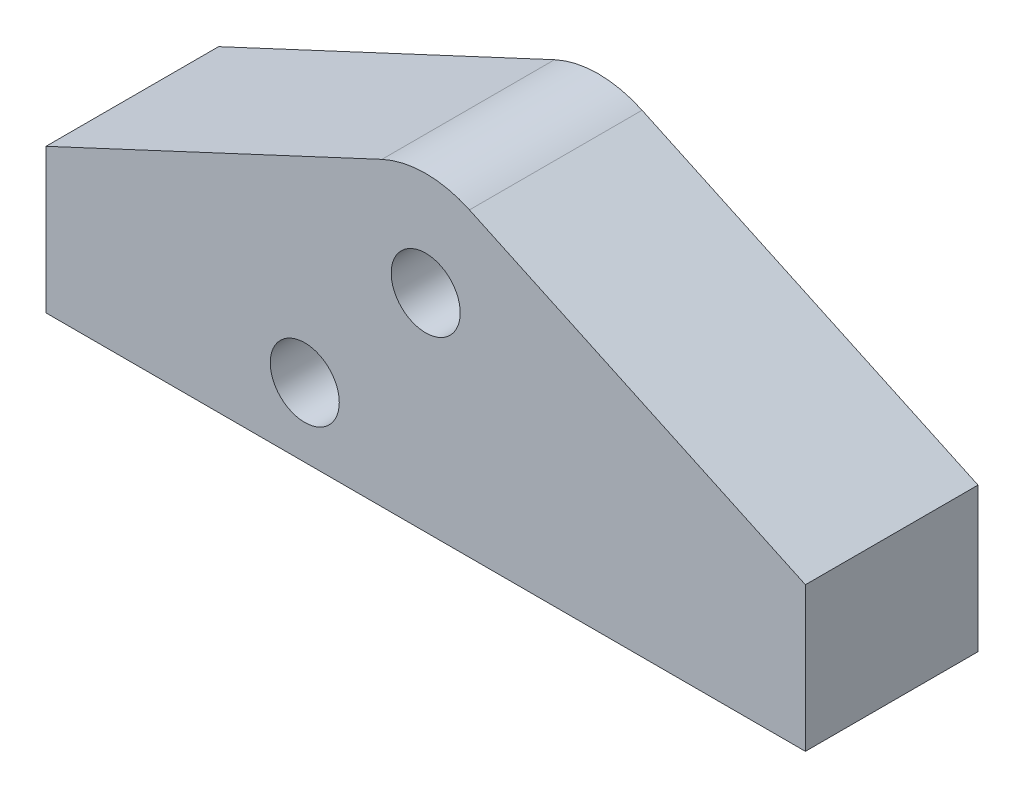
from build123d import *

# Parameters (mm, degrees)
BOSS_EXTRUDE1_DEPTH      = 9.525
BOSS_EXTRUDE1_DEPTH_BACK = 6.35
SKETCH2_R                = 3.175
SKETCH3_R                = 3.175
CUT_EXTRUDE1_DEPTH       = 15.875


with BuildPart() as part:
    # Sketch2 → Boss-Extrude1 (new, two sides: drawn at the far end of the back side and taken through both)
    with BuildSketch(Plane.XY.offset(-BOSS_EXTRUDE1_DEPTH_BACK)):
        with BuildLine():
            Line((-34.925, -19.05), (34.925, -19.05))
            Line((34.925, -19.05), (34.925, -5.776120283))
            Line((34.925, -5.776120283), (4.025438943, 8.632581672))
            ThreePointArc((4.025438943, 8.632581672), (0, 9.525), (-4.025438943, 8.632581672))
            Line((-4.025438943, 8.632581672), (-34.925, -5.776120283))
            Line((-34.925, -5.776120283), (-34.925, -19.05))
        make_face()
        Circle(SKETCH2_R, mode=Mode.SUBTRACT)
        with Locations((-11.1252, -12.7)):
            Circle(SKETCH2_R, mode=Mode.SUBTRACT)
    extrude(amount=BOSS_EXTRUDE1_DEPTH + BOSS_EXTRUDE1_DEPTH_BACK)

    # Sketch3 → Cut-Extrude1 (cut)
    with BuildSketch(Plane.XZ.offset(19.05)):
        with Locations((-25.4, 0)):
            Circle(SKETCH3_R)
        with Locations((25.4, 0)):
            Circle(SKETCH3_R)
    extrude(amount=-CUT_EXTRUDE1_DEPTH, mode=Mode.SUBTRACT)


solid = part.part
